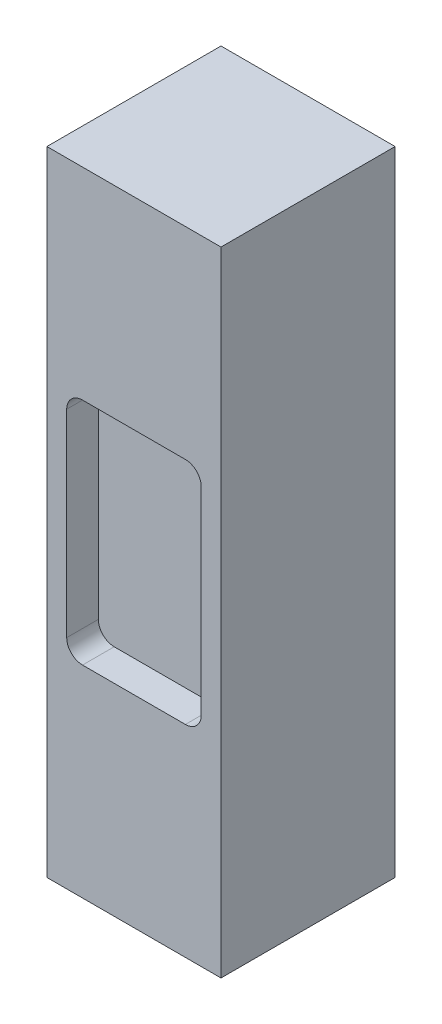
from build123d import *

# Parameters (mm, degrees)
SKETCH2_W           = 139.7
SKETCH2_H           = 139.7
BOSS_EXTRUDE1_DEPTH = 508
SKETCH3_W           = 107.95
SKETCH3_H           = 184.15
CUT_EXTRUDE1_DEPTH  = 25.4
FILLET1_R           = 12.7


with BuildPart() as part:
    # Sketch2 → Boss-Extrude1 (new body)
    with BuildSketch(Plane(origin=(0, 0, 0), x_dir=(1, 0, 0), z_dir=(0, 1, 0))):
        Rectangle(SKETCH2_W, SKETCH2_H)
    extrude(amount=BOSS_EXTRUDE1_DEPTH)

    # Sketch3 → Cut-Extrude1 (cut)
    with BuildSketch(Plane.XY.offset(69.85)):
        with Locations((0, 254)):
            Rectangle(SKETCH3_W, SKETCH3_H)
    extrude(amount=-CUT_EXTRUDE1_DEPTH, mode=Mode.SUBTRACT)

    # Fillet1
    fillet1_edges = [part.edges().sort_by_distance(p)[0] for p in [
        (-53.975, 161.925, 57.15),
        (-53.975, 346.075, 57.15),
        (53.975, 346.075, 57.15),
        (53.975, 161.925, 57.15),
    ]]
    fillet(fillet1_edges, radius=FILLET1_R)


solid = part.part
